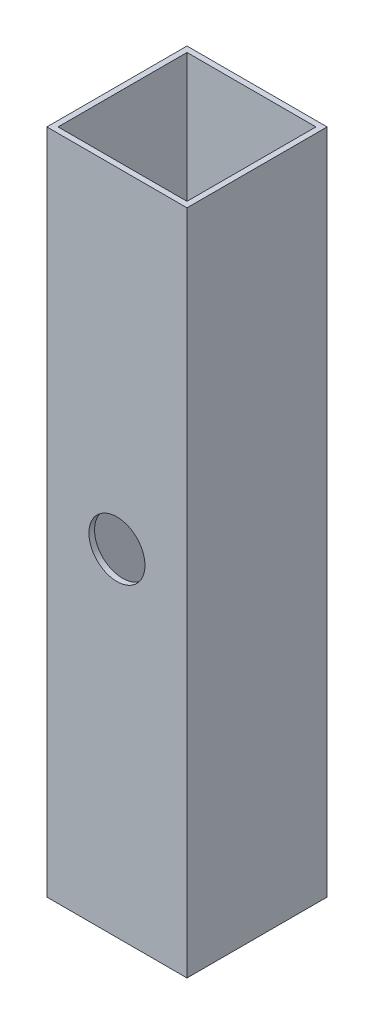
from build123d import *

# Parameters (mm, degrees)
SKETCH2_W           = 63.5
SKETCH2_H           = 63.5
BOSS_EXTRUDE2_DEPTH = 304.8
SKETCH3_W           = 58.42
SKETCH3_H           = 58.42
CUT_EXTRUDE2_DEPTH  = 302.26
SKETCH5_W           = 63.5
SKETCH5_H           = 63.5
CUT_EXTRUDE3_DEPTH  = 2.54
SKETCH6_R           = 12.7
CUT_EXTRUDE4_DEPTH  = 12.7


with BuildPart() as part:
    # Sketch2 → Boss-Extrude2 (new body)
    with BuildSketch(Plane(origin=(0, 0, 0), x_dir=(1, 0, 0), z_dir=(0, 1, 0))):
        with Locations((31.75, 31.75)):
            Rectangle(SKETCH2_W, SKETCH2_H)
    extrude(amount=-BOSS_EXTRUDE2_DEPTH)

    # Sketch3 → Cut-Extrude2 (cut)
    with BuildSketch(Plane(origin=(0, 0, 0), x_dir=(1, 0, 0), z_dir=(0, 1, 0))):
        with Locations((31.75, 31.75)):
            Rectangle(SKETCH3_W, SKETCH3_H)
    extrude(amount=-CUT_EXTRUDE2_DEPTH, mode=Mode.SUBTRACT)

    # Sketch5 → Cut-Extrude3 (cut)
    with BuildSketch(Plane(origin=(0, 0, 0), x_dir=(1, 0, 0), z_dir=(0, 1, 0))):
        with Locations((31.75, 31.75)):
            Rectangle(SKETCH5_W, SKETCH5_H)
    extrude(amount=-CUT_EXTRUDE3_DEPTH, mode=Mode.SUBTRACT)

    # Sketch6 → Cut-Extrude4 (cut)
    with BuildSketch(Plane.XY):
        with Locations((31.75, -152.4)):
            Circle(SKETCH6_R)
    extrude(amount=-CUT_EXTRUDE4_DEPTH, mode=Mode.SUBTRACT)


solid = part.part
